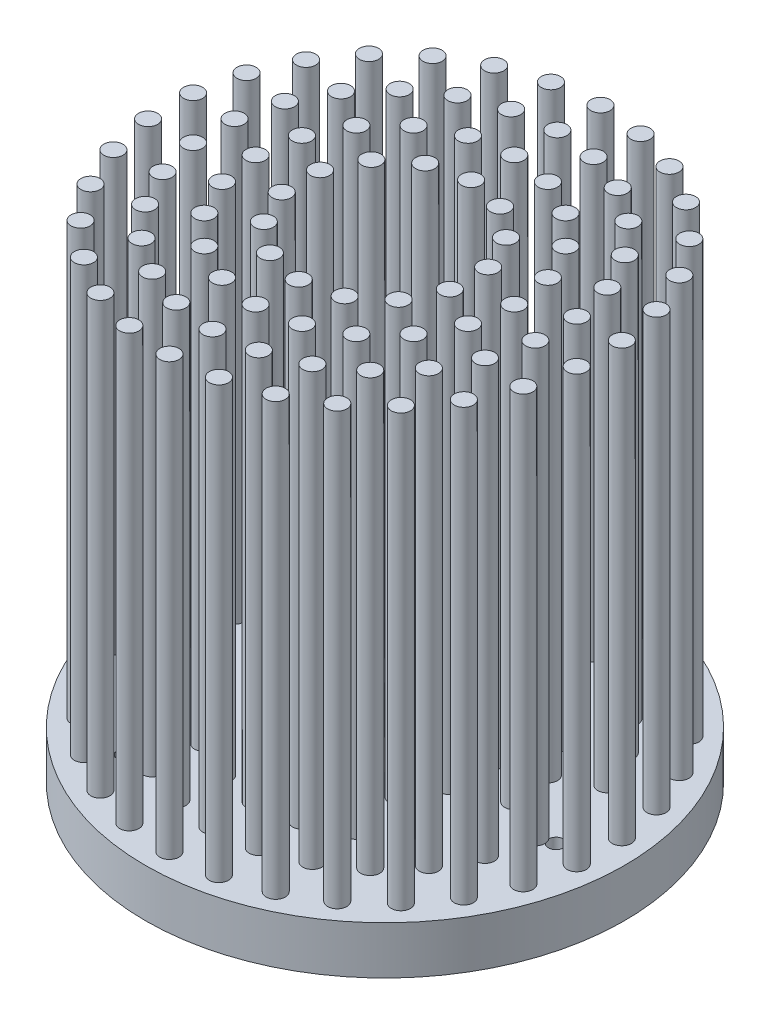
from build123d import *

# Parameters (mm, degrees)
SKETCH_1_R                = 25
EXTRUDE_1_DEPTH           = 3
SKETCH_2_R                = 1
EXTRUDE_2_DEPTH           = 27
SKETCH_5_R                = 25
EXTRUDE_5_DEPTH           = 2
M2X0_4_TAPPED_HOLE1_D     = 1.6
M2X0_4_TAPPED_HOLE1_DEPTH = 6
M2X0_4_TAPPED_HOLE1_TIP   = 0.480688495
SKETCH_6_R                = 1
EXTRUDE_6_DEPTH           = 45
SKETCH5_R                 = 5.75
EXTRUDE4_DEPTH            = 62.237243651


with BuildPart() as part:
    # Sketch 1 → Extrude 1 (new body)
    with BuildSketch(Plane(origin=(0, 0, 0), x_dir=(1, 0, 0), z_dir=(0, 1, 0))):
        with Locations(Location((0, 0, 0), (0, 0, 270))):
            Circle(SKETCH_1_R)
    extrude(amount=EXTRUDE_1_DEPTH)

    # Sketch 2 → Extrude 2 (add)
    with BuildSketch(Plane(origin=(0, 3, 0), x_dir=(1, 0, 0), z_dir=(0, 1, 0))):
        with Locations(Location((0, 0, 0), (0, 0, 270))):
            Circle(SKETCH_2_R)
        with Locations(Location((0, -4.5, 0), (0, 0, 270))):
            Circle(SKETCH_2_R)
        with Locations(Location((0, -9, 0), (0, 0, 270))):
            Circle(SKETCH_2_R)
        with Locations(Location((0, -13.5, 0), (0, 0, 270))):
            Circle(SKETCH_2_R)
        with Locations(Location((0, -18, 0), (0, 0, 270))):
            Circle(SKETCH_2_R)
        with Locations(Location((-4.307681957, -17.476952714, 0), (0, 0, 270))):
            Circle(SKETCH_2_R)
        with Locations(Location((-8.365017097, -15.938208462, 0), (0, 0, 270))):
            Circle(SKETCH_2_R)
        with Locations(Location((-11.936207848, -13.473193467, 0), (0, 0, 270))):
            Circle(SKETCH_2_R)
        with Locations(Location((-14.813709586, -10.225165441, 0), (0, 0, 270))):
            Circle(SKETCH_2_R)
        with Locations(Location((-16.830292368, -6.382887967, 0), (0, 0, 270))):
            Circle(SKETCH_2_R)
        with Locations(Location((-17.868759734, -2.169660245, 0), (0, 0, 270))):
            Circle(SKETCH_2_R)
        with Locations(Location((-17.868759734, 2.169660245, 0), (0, 0, 270))):
            Circle(SKETCH_2_R)
        with Locations(Location((-16.830292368, 6.382887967, 0), (0, 0, 270))):
            Circle(SKETCH_2_R)
        with Locations(Location((-14.813709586, 10.225165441, 0), (0, 0, 270))):
            Circle(SKETCH_2_R)
        with Locations(Location((-11.936207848, 13.473193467, 0), (0, 0, 270))):
            Circle(SKETCH_2_R)
        with Locations(Location((-8.365017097, 15.938208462, 0), (0, 0, 270))):
            Circle(SKETCH_2_R)
        with Locations(Location((-4.307681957, 17.476952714, 0), (0, 0, 270))):
            Circle(SKETCH_2_R)
        with Locations(Location((0, 18, 0), (0, 0, 270))):
            Circle(SKETCH_2_R)
        with Locations(Location((4.307681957, 17.476952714, 0), (0, 0, 270))):
            Circle(SKETCH_2_R)
        with Locations(Location((8.365017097, 15.938208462, 0), (0, 0, 270))):
            Circle(SKETCH_2_R)
        with Locations(Location((11.936207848, 13.473193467, 0), (0, 0, 270))):
            Circle(SKETCH_2_R)
        with Locations(Location((14.813709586, 10.225165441, 0), (0, 0, 270))):
            Circle(SKETCH_2_R)
        with Locations(Location((16.830292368, 6.382887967, 0), (0, 0, 270))):
            Circle(SKETCH_2_R)
        with Locations(Location((17.868759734, 2.169660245, 0), (0, 0, 270))):
            Circle(SKETCH_2_R)
        with Locations(Location((17.868759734, -2.169660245, 0), (0, 0, 270))):
            Circle(SKETCH_2_R)
        with Locations(Location((16.830292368, -6.382887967, 0), (0, 0, 270))):
            Circle(SKETCH_2_R)
        with Locations(Location((14.813709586, -10.225165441, 0), (0, 0, 270))):
            Circle(SKETCH_2_R)
        with Locations(Location((11.936207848, -13.473193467, 0), (0, 0, 270))):
            Circle(SKETCH_2_R)
        with Locations(Location((8.365017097, -15.938208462, 0), (0, 0, 270))):
            Circle(SKETCH_2_R)
        with Locations(Location((4.307681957, -17.476952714, 0), (0, 0, 270))):
            Circle(SKETCH_2_R)
        with Locations(Location((-4.171729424, -12.83926297, 0), (0, 0, 270))):
            Circle(SKETCH_2_R)
        with Locations(Location((-7.935100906, -10.921729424, 0), (0, 0, 270))):
            Circle(SKETCH_2_R)
        with Locations(Location((-10.921729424, -7.935100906, 0), (0, 0, 270))):
            Circle(SKETCH_2_R)
        with Locations(Location((-12.83926297, -4.171729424, 0), (0, 0, 270))):
            Circle(SKETCH_2_R)
        with Locations(Location((-13.5, 0, 0), (0, 0, 270))):
            Circle(SKETCH_2_R)
        with Locations(Location((-12.83926297, 4.171729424, 0), (0, 0, 270))):
            Circle(SKETCH_2_R)
        with Locations(Location((-10.921729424, 7.935100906, 0), (0, 0, 270))):
            Circle(SKETCH_2_R)
        with Locations(Location((-7.935100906, 10.921729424, 0), (0, 0, 270))):
            Circle(SKETCH_2_R)
        with Locations(Location((-4.171729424, 12.83926297, 0), (0, 0, 270))):
            Circle(SKETCH_2_R)
        with Locations(Location((0, 13.5, 0), (0, 0, 270))):
            Circle(SKETCH_2_R)
        with Locations(Location((4.171729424, 12.83926297, 0), (0, 0, 270))):
            Circle(SKETCH_2_R)
        with Locations(Location((7.935100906, 10.921729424, 0), (0, 0, 270))):
            Circle(SKETCH_2_R)
        with Locations(Location((10.921729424, 7.935100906, 0), (0, 0, 270))):
            Circle(SKETCH_2_R)
        with Locations(Location((12.83926297, 4.171729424, 0), (0, 0, 270))):
            Circle(SKETCH_2_R)
        with Locations(Location((13.5, 0, 0), (0, 0, 270))):
            Circle(SKETCH_2_R)
        with Locations(Location((12.83926297, -4.171729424, 0), (0, 0, 270))):
            Circle(SKETCH_2_R)
        with Locations(Location((10.921729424, -7.935100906, 0), (0, 0, 270))):
            Circle(SKETCH_2_R)
        with Locations(Location((7.935100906, -10.921729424, 0), (0, 0, 270))):
            Circle(SKETCH_2_R)
        with Locations(Location((4.171729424, -12.83926297, 0), (0, 0, 270))):
            Circle(SKETCH_2_R)
        with Locations(Location((-3.904953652, -8.108719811, 0), (0, 0, 270))):
            Circle(SKETCH_2_R)
        with Locations(Location((-7.036483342, -5.611408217, 0), (0, 0, 270))):
            Circle(SKETCH_2_R)
        with Locations(Location((-8.77435121, -2.002688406, 0), (0, 0, 270))):
            Circle(SKETCH_2_R)
        with Locations(Location((-8.77435121, 2.002688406, 0), (0, 0, 270))):
            Circle(SKETCH_2_R)
        with Locations(Location((-7.036483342, 5.611408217, 0), (0, 0, 270))):
            Circle(SKETCH_2_R)
        with Locations(Location((-3.904953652, 8.108719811, 0), (0, 0, 270))):
            Circle(SKETCH_2_R)
        with Locations(Location((0, 9, 0), (0, 0, 270))):
            Circle(SKETCH_2_R)
        with Locations(Location((3.904953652, 8.108719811, 0), (0, 0, 270))):
            Circle(SKETCH_2_R)
        with Locations(Location((7.036483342, 5.611408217, 0), (0, 0, 270))):
            Circle(SKETCH_2_R)
        with Locations(Location((8.77435121, 2.002688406, 0), (0, 0, 270))):
            Circle(SKETCH_2_R)
        with Locations(Location((8.77435121, -2.002688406, 0), (0, 0, 270))):
            Circle(SKETCH_2_R)
        with Locations(Location((7.036483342, -5.611408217, 0), (0, 0, 270))):
            Circle(SKETCH_2_R)
        with Locations(Location((3.904953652, -8.108719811, 0), (0, 0, 270))):
            Circle(SKETCH_2_R)
        with Locations(Location((-3.518241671, -2.805704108, 0), (0, 0, 270))):
            Circle(SKETCH_2_R)
        with Locations(Location((-4.387175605, 1.001344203, 0), (0, 0, 270))):
            Circle(SKETCH_2_R)
        with Locations(Location((-1.952476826, 4.054359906, 0), (0, 0, 270))):
            Circle(SKETCH_2_R)
        with Locations(Location((1.952476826, 4.054359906, 0), (0, 0, 270))):
            Circle(SKETCH_2_R)
        with Locations(Location((4.387175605, 1.001344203, 0), (0, 0, 270))):
            Circle(SKETCH_2_R)
        with Locations(Location((3.518241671, -2.805704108, 0), (0, 0, 270))):
            Circle(SKETCH_2_R)
        with Locations(Location((0, 22.5, 0), (0, 0, 270))):
            Circle(SKETCH_2_R)
        with Locations(Location((4.678013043, 22.008321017, 0), (0, 0, 270))):
            Circle(SKETCH_2_R)
        with Locations(Location((9.151574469, 20.554772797, 0), (0, 0, 270))):
            Circle(SKETCH_2_R)
        with Locations(Location((13.225168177, 18.202882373, 0), (0, 0, 270))):
            Circle(SKETCH_2_R)
        with Locations(Location((16.720758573, 15.055438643, 0), (0, 0, 270))):
            Circle(SKETCH_2_R)
        with Locations(Location((19.485571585, 11.25, 0), (0, 0, 270))):
            Circle(SKETCH_2_R)
        with Locations(Location((21.398771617, 6.952882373, 0), (0, 0, 270))):
            Circle(SKETCH_2_R)
        with Locations(Location((22.376742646, 2.351890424, 0), (0, 0, 270))):
            Circle(SKETCH_2_R)
        with Locations(Location((22.376742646, -2.351890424, 0), (0, 0, 270))):
            Circle(SKETCH_2_R)
        with Locations(Location((21.398771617, -6.952882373, 0), (0, 0, 270))):
            Circle(SKETCH_2_R)
        with Locations(Location((19.485571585, -11.25, 0), (0, 0, 270))):
            Circle(SKETCH_2_R)
        with Locations(Location((16.720758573, -15.055438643, 0), (0, 0, 270))):
            Circle(SKETCH_2_R)
        with Locations(Location((13.225168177, -18.202882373, 0), (0, 0, 270))):
            Circle(SKETCH_2_R)
        with Locations(Location((9.151574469, -20.554772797, 0), (0, 0, 270))):
            Circle(SKETCH_2_R)
        with Locations(Location((4.678013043, -22.008321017, 0), (0, 0, 270))):
            Circle(SKETCH_2_R)
        with Locations(Location((0, -22.5, 0), (0, 0, 270))):
            Circle(SKETCH_2_R)
        with Locations(Location((-4.678013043, -22.008321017, 0), (0, 0, 270))):
            Circle(SKETCH_2_R)
        with Locations(Location((-9.151574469, -20.554772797, 0), (0, 0, 270))):
            Circle(SKETCH_2_R)
        with Locations(Location((-13.225168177, -18.202882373, 0), (0, 0, 270))):
            Circle(SKETCH_2_R)
        with Locations(Location((-16.720758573, -15.055438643, 0), (0, 0, 270))):
            Circle(SKETCH_2_R)
        with Locations(Location((-19.485571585, -11.25, 0), (0, 0, 270))):
            Circle(SKETCH_2_R)
        with Locations(Location((-21.398771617, -6.952882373, 0), (0, 0, 270))):
            Circle(SKETCH_2_R)
        with Locations(Location((-22.376742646, -2.351890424, 0), (0, 0, 270))):
            Circle(SKETCH_2_R)
        with Locations(Location((-22.376742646, 2.351890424, 0), (0, 0, 270))):
            Circle(SKETCH_2_R)
        with Locations(Location((-21.398771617, 6.952882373, 0), (0, 0, 270))):
            Circle(SKETCH_2_R)
        with Locations(Location((-19.485571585, 11.25, 0), (0, 0, 270))):
            Circle(SKETCH_2_R)
        with Locations(Location((-16.720758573, 15.055438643, 0), (0, 0, 270))):
            Circle(SKETCH_2_R)
        with Locations(Location((-13.225168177, 18.202882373, 0), (0, 0, 270))):
            Circle(SKETCH_2_R)
        with Locations(Location((-9.151574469, 20.554772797, 0), (0, 0, 270))):
            Circle(SKETCH_2_R)
        with Locations(Location((-4.678013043, 22.008321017, 0), (0, 0, 270))):
            Circle(SKETCH_2_R)
    extrude(amount=EXTRUDE_2_DEPTH)

    # Sketch 5 → Extrude 5 (add)
    with BuildSketch(Plane(origin=(0, 3, 0), x_dir=(1, 0, 0), z_dir=(0, 1, 0))):
        with Locations(Location((0, 0, 0), (0, 0, 270))):
            Circle(SKETCH_5_R)
    extrude(amount=EXTRUDE_5_DEPTH)

    # M2x0.4 Tapped Hole1
    with Locations(Plane.XZ):
        with Locations((-11.077262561, 16.048185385), (19.436767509, 1.56909809), (-8.359504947, -17.617283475)):
            Hole(M2X0_4_TAPPED_HOLE1_D / 2, depth=M2X0_4_TAPPED_HOLE1_DEPTH)
            with Locations((0, 0, -(M2X0_4_TAPPED_HOLE1_DEPTH + M2X0_4_TAPPED_HOLE1_TIP / 2))):  # 118° drill point
                Cone(0, M2X0_4_TAPPED_HOLE1_D / 2, M2X0_4_TAPPED_HOLE1_TIP, mode=Mode.SUBTRACT)

    # Sketch 6 → Extrude 6 (add)
    with BuildSketch(Plane(origin=(0, 5, 0), x_dir=(1, 0, 0), z_dir=(0, 1, 0))):
        with Locations(Location((0, 22.5, 0), (0, 0, 270))):
            Circle(SKETCH_6_R)
        with Locations(Location((-4.307681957, -17.476952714, 0), (0, 0, 270))):
            Circle(SKETCH_6_R)
        with Locations(Location((0, -18, 0), (0, 0, 270))):
            Circle(SKETCH_6_R)
        with Locations(Location((0, -13.5, 0), (0, 0, 270))):
            Circle(SKETCH_6_R)
        with Locations(Location((0, -9, 0), (0, 0, 270))):
            Circle(SKETCH_6_R)
        with Locations(Location((0, -4.5, 0), (0, 0, 270))):
            Circle(SKETCH_6_R)
        with Locations(Location((0, 0, 0), (0, 0, 270))):
            Circle(SKETCH_6_R)
        with Locations(Location((-14.813709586, 10.225165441, 0), (0, 0, 270))):
            Circle(SKETCH_6_R)
        with Locations(Location((-16.830292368, 6.382887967, 0), (0, 0, 270))):
            Circle(SKETCH_6_R)
        with Locations(Location((-17.868759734, 2.169660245, 0), (0, 0, 270))):
            Circle(SKETCH_6_R)
        with Locations(Location((-17.868759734, -2.169660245, 0), (0, 0, 270))):
            Circle(SKETCH_6_R)
        with Locations(Location((-16.830292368, -6.382887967, 0), (0, 0, 270))):
            Circle(SKETCH_6_R)
        with Locations(Location((-14.813709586, -10.225165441, 0), (0, 0, 270))):
            Circle(SKETCH_6_R)
        with Locations(Location((-11.936207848, -13.473193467, 0), (0, 0, 270))):
            Circle(SKETCH_6_R)
        with Locations(Location((-8.365017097, -15.938208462, 0), (0, 0, 270))):
            Circle(SKETCH_6_R)
        with Locations(Location((14.813709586, 10.225165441, 0), (0, 0, 270))):
            Circle(SKETCH_6_R)
        with Locations(Location((11.936207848, 13.473193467, 0), (0, 0, 270))):
            Circle(SKETCH_6_R)
        with Locations(Location((8.365017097, 15.938208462, 0), (0, 0, 270))):
            Circle(SKETCH_6_R)
        with Locations(Location((4.307681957, 17.476952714, 0), (0, 0, 270))):
            Circle(SKETCH_6_R)
        with Locations(Location((0, 18, 0), (0, 0, 270))):
            Circle(SKETCH_6_R)
        with Locations(Location((-4.307681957, 17.476952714, 0), (0, 0, 270))):
            Circle(SKETCH_6_R)
        with Locations(Location((-8.365017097, 15.938208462, 0), (0, 0, 108.595174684))):
            Circle(SKETCH_6_R)
        with Locations(Location((-11.936207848, 13.473193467, 0), (0, 0, 270))):
            Circle(SKETCH_6_R)
        with Locations(Location((4.307681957, -17.476952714, 0), (0, 0, 270))):
            Circle(SKETCH_6_R)
        with Locations(Location((8.365017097, -15.938208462, 0), (0, 0, 270))):
            Circle(SKETCH_6_R)
        with Locations(Location((11.936207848, -13.473193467, 0), (0, 0, 270))):
            Circle(SKETCH_6_R)
        with Locations(Location((14.813709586, -10.225165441, 0), (0, 0, 270))):
            Circle(SKETCH_6_R)
        with Locations(Location((16.830292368, -6.382887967, 0), (0, 0, 270))):
            Circle(SKETCH_6_R)
        with Locations(Location((17.868759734, -2.169660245, 0), (0, 0, 39.740590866))):
            Circle(SKETCH_6_R)
        with Locations(Location((17.868759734, 2.169660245, 0), (0, 0, 270))):
            Circle(SKETCH_6_R)
        with Locations(Location((16.830292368, 6.382887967, 0), (0, 0, 270))):
            Circle(SKETCH_6_R)
        with Locations(Location((-7.935100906, 10.921729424, 0), (0, 0, 270))):
            Circle(SKETCH_6_R)
        with Locations(Location((-10.921729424, 7.935100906, 0), (0, 0, 270))):
            Circle(SKETCH_6_R)
        with Locations(Location((-12.83926297, 4.171729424, 0), (0, 0, 270))):
            Circle(SKETCH_6_R)
        with Locations(Location((-13.5, 0, 0), (0, 0, 270))):
            Circle(SKETCH_6_R)
        with Locations(Location((-12.83926297, -4.171729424, 0), (0, 0, 270))):
            Circle(SKETCH_6_R)
        with Locations(Location((-10.921729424, -7.935100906, 0), (0, 0, 270))):
            Circle(SKETCH_6_R)
        with Locations(Location((-7.935100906, -10.921729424, 0), (0, 0, 270))):
            Circle(SKETCH_6_R)
        with Locations(Location((-4.171729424, -12.83926297, 0), (0, 0, 270))):
            Circle(SKETCH_6_R)
        with Locations(Location((12.83926297, -4.171729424, 0), (0, 0, 270))):
            Circle(SKETCH_6_R)
        with Locations(Location((13.5, 0, 0), (0, 0, 270))):
            Circle(SKETCH_6_R)
        with Locations(Location((12.83926297, 4.171729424, 0), (0, 0, 270))):
            Circle(SKETCH_6_R)
        with Locations(Location((10.921729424, 7.935100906, 0), (0, 0, 270))):
            Circle(SKETCH_6_R)
        with Locations(Location((7.935100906, 10.921729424, 0), (0, 0, 270))):
            Circle(SKETCH_6_R)
        with Locations(Location((4.171729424, 12.83926297, 0), (0, 0, 270))):
            Circle(SKETCH_6_R)
        with Locations(Location((0, 13.5, 0), (0, 0, 270))):
            Circle(SKETCH_6_R)
        with Locations(Location((-4.171729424, 12.83926297, 0), (0, 0, 270))):
            Circle(SKETCH_6_R)
        with Locations(Location((-7.036483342, 5.611408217, 0), (0, 0, 270))):
            Circle(SKETCH_6_R)
        with Locations(Location((-8.77435121, 2.002688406, 0), (0, 0, 270))):
            Circle(SKETCH_6_R)
        with Locations(Location((-8.77435121, -2.002688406, 0), (0, 0, 270))):
            Circle(SKETCH_6_R)
        with Locations(Location((-7.036483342, -5.611408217, 0), (0, 0, 270))):
            Circle(SKETCH_6_R)
        with Locations(Location((-3.904953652, -8.108719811, 0), (0, 0, 270))):
            Circle(SKETCH_6_R)
        with Locations(Location((4.171729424, -12.83926297, 0), (0, 0, 270))):
            Circle(SKETCH_6_R)
        with Locations(Location((7.935100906, -10.921729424, 0), (0, 0, 270))):
            Circle(SKETCH_6_R)
        with Locations(Location((10.921729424, -7.935100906, 0), (0, 0, 270))):
            Circle(SKETCH_6_R)
        with Locations(Location((3.904953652, -8.108719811, 0), (0, 0, 270))):
            Circle(SKETCH_6_R)
        with Locations(Location((7.036483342, -5.611408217, 0), (0, 0, 270))):
            Circle(SKETCH_6_R)
        with Locations(Location((8.77435121, -2.002688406, 0), (0, 0, 270))):
            Circle(SKETCH_6_R)
        with Locations(Location((8.77435121, 2.002688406, 0), (0, 0, 270))):
            Circle(SKETCH_6_R)
        with Locations(Location((7.036483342, 5.611408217, 0), (0, 0, 270))):
            Circle(SKETCH_6_R)
        with Locations(Location((3.904953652, 8.108719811, 0), (0, 0, 270))):
            Circle(SKETCH_6_R)
        with Locations(Location((0, 9, 0), (0, 0, 270))):
            Circle(SKETCH_6_R)
        with Locations(Location((-3.904953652, 8.108719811, 0), (0, 0, 270))):
            Circle(SKETCH_6_R)
        with Locations(Location((3.518241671, -2.805704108, 0), (0, 0, 270))):
            Circle(SKETCH_6_R)
        with Locations(Location((4.387175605, 1.001344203, 0), (0, 0, 270))):
            Circle(SKETCH_6_R)
        with Locations(Location((1.952476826, 4.054359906, 0), (0, 0, 270))):
            Circle(SKETCH_6_R)
        with Locations(Location((-1.952476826, 4.054359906, 0), (0, 0, 270))):
            Circle(SKETCH_6_R)
        with Locations(Location((-4.387175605, 1.001344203, 0), (0, 0, 270))):
            Circle(SKETCH_6_R)
        with Locations(Location((-3.518241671, -2.805704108, 0), (0, 0, 270))):
            Circle(SKETCH_6_R)
        with Locations(Location((22.376742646, -2.351890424, 0), (0, 0, 270))):
            Circle(SKETCH_6_R)
        with Locations(Location((22.376742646, 2.351890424, 0), (0, 0, 270))):
            Circle(SKETCH_6_R)
        with Locations(Location((21.398771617, 6.952882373, 0), (0, 0, 270))):
            Circle(SKETCH_6_R)
        with Locations(Location((19.485571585, 11.25, 0), (0, 0, 270))):
            Circle(SKETCH_6_R)
        with Locations(Location((16.720758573, 15.055438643, 0), (0, 0, 270))):
            Circle(SKETCH_6_R)
        with Locations(Location((13.225168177, 18.202882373, 0), (0, 0, 270))):
            Circle(SKETCH_6_R)
        with Locations(Location((9.151574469, 20.554772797, 0), (0, 0, 270))):
            Circle(SKETCH_6_R)
        with Locations(Location((4.678013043, 22.008321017, 0), (0, 0, 270))):
            Circle(SKETCH_6_R)
        with Locations(Location((-4.678013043, -22.008321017, 0), (0, 0, 270))):
            Circle(SKETCH_6_R)
        with Locations(Location((0, -22.5, 0), (0, 0, 270))):
            Circle(SKETCH_6_R)
        with Locations(Location((4.678013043, -22.008321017, 0), (0, 0, 270))):
            Circle(SKETCH_6_R)
        with Locations(Location((9.151574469, -20.554772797, 0), (0, 0, 270))):
            Circle(SKETCH_6_R)
        with Locations(Location((13.225168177, -18.202882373, 0), (0, 0, 270))):
            Circle(SKETCH_6_R)
        with Locations(Location((16.720758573, -15.055438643, 0), (0, 0, 270))):
            Circle(SKETCH_6_R)
        with Locations(Location((19.485571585, -11.25, 0), (0, 0, 270))):
            Circle(SKETCH_6_R)
        with Locations(Location((21.398771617, -6.952882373, 0), (0, 0, 270))):
            Circle(SKETCH_6_R)
        with Locations(Location((-21.398771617, 6.952882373, 0), (0, 0, 270))):
            Circle(SKETCH_6_R)
        with Locations(Location((-22.376742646, 2.351890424, 0), (0, 0, 270))):
            Circle(SKETCH_6_R)
        with Locations(Location((-22.376742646, -2.351890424, 0), (0, 0, 270))):
            Circle(SKETCH_6_R)
        with Locations(Location((-21.398771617, -6.952882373, 0), (0, 0, 270))):
            Circle(SKETCH_6_R)
        with Locations(Location((-19.485571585, -11.25, 0), (0, 0, 270))):
            Circle(SKETCH_6_R)
        with Locations(Location((-16.720758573, -15.055438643, 0), (0, 0, 270))):
            Circle(SKETCH_6_R)
        with Locations(Location((-13.225168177, -18.202882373, 0), (0, 0, 270))):
            Circle(SKETCH_6_R)
        with Locations(Location((-9.151574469, -20.554772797, 0), (0, 0, 270))):
            Circle(SKETCH_6_R)
        with Locations(Location((-4.678013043, 22.008321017, 0), (0, 0, 270))):
            Circle(SKETCH_6_R)
        with Locations(Location((-9.151574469, 20.554772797, 0), (0, 0, 270))):
            Circle(SKETCH_6_R)
        with Locations(Location((-13.225168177, 18.202882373, 0), (0, 0, 270))):
            Circle(SKETCH_6_R)
        with Locations(Location((-16.720758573, 15.055438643, 0), (0, 0, 270))):
            Circle(SKETCH_6_R)
        with Locations(Location((-19.485571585, 11.25, 0), (0, 0, 270))):
            Circle(SKETCH_6_R)
    extrude(amount=EXTRUDE_6_DEPTH)

    # Sketch5 → Extrude4 (cut, through all)
    with BuildSketch(Plane.XZ):
        with Locations(Location((0, 0, 0), (0, 0, 270))):
            Circle(SKETCH5_R)
    extrude(amount=-EXTRUDE4_DEPTH, mode=Mode.SUBTRACT)


solid = part.part
